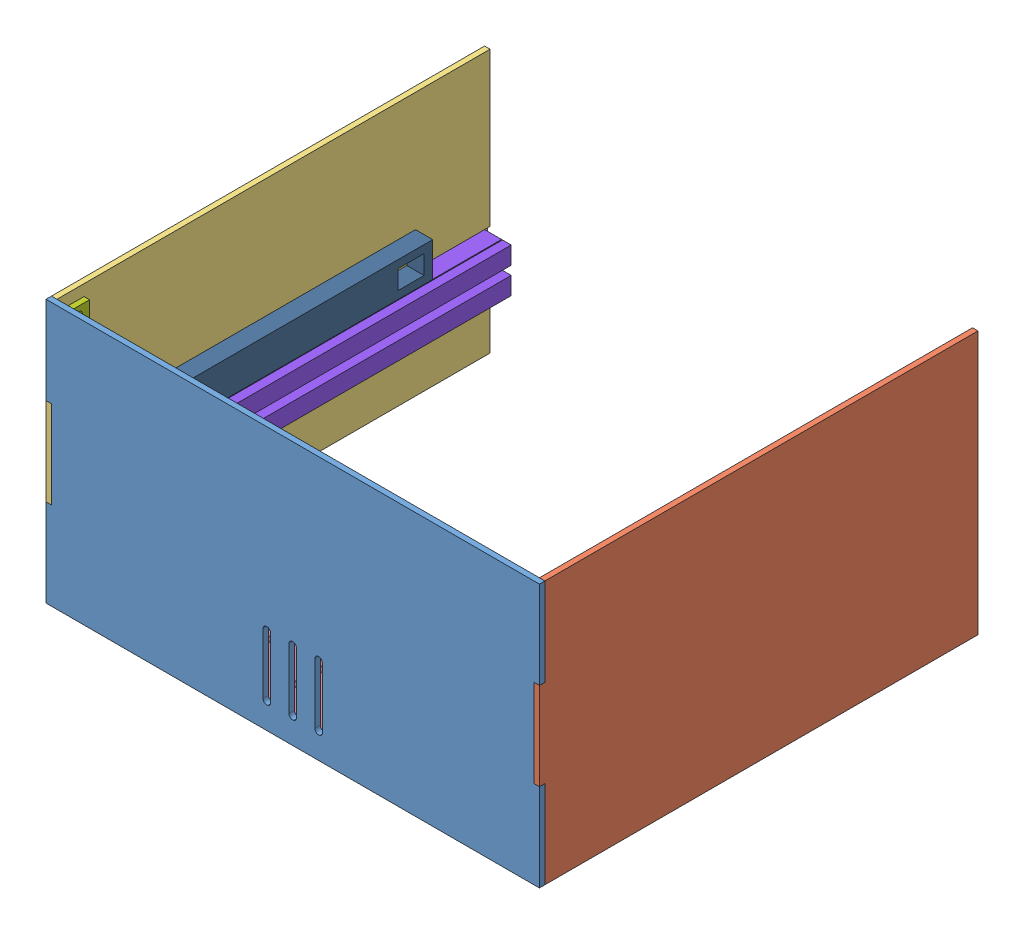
SolidWorks assembly Rear Storage Assembly.SLDASM, configuration Default (file format 15000). Lengths in mm.
Overall size (285.75 159.48 254).
27 component instances, 11 part files, 51 mates.
Components (placement in the parent):
- Back-1: Back.SLDPRT [Default] at (107.9127 113.5491 195.6866) size (285.75 152.4 3.17)
- Side L-1: Side L.SLDPRT [Default] at (249.2002 113.5491 70.2741) size (3.17 152.4 254)
- Side R-1: Side R.SLDPRT [Default] at (-33.3748 113.5491 70.2741) size (3.17 152.4 254)
- 535052 assembly.STEP-1: 535052 assembly.STEP.SLDASM [Default] at (282.3286 130.5293 143.5678) x (0.707107 0 -0.707107) z (-0.707107 0 -0.707107) size (49.1 20.57 32.16) (suppressed, hidden)
  - 535052 housing.STEP-1: 535052 housing.STEP.SLDPRT [Default] at (-60.2789 7.3005 21.3437) size (49.1 16.21 32.16)
  - 535052 ball.STEP-1: 535052 ball.STEP.SLDPRT [Default] at (-60.2789 7.3005 21.3437) size (15.88 15.88 15.88)
- Ball Transfer Bracket-1: Ball Transfer Bracket.SLDPRT [Default] at (224.6127 123.2288 171.0991) (suppressed, hidden)
- 535052 assembly.STEP-2: 535052 assembly.STEP.SLDASM [Default] at (-36.3186 130.5293 113.3832) x (-0.707107 0 -0.707107) z (-0.707107 0 0.707107) size (49.1 20.57 32.16) (suppressed, hidden)
  - 535052 housing.STEP-1: 535052 housing.STEP.SLDPRT [Default] at (-60.2789 7.3005 21.3437) size (49.1 16.21 32.16)
  - 535052 ball.STEP-1: 535052 ball.STEP.SLDPRT [Default] at (-60.2789 7.3005 21.3437) size (15.88 15.88 15.88)
- Ball Transfer Bracket-2: Ball Transfer Bracket.SLDPRT [Default] at (-8.7873 123.2288 171.0991) x (0 0 1) z (-1 0 0) (suppressed, hidden)
- 57655K62_14-1 2 Degree Pressure Angle Gear Rack-1: 57655K62_14-1 2 Degree Pressure Angle Gear Rack.SLDPRT [57655K62] at (246.819 154.0304 63.9241) x (0 0 1) z (0 -1 0) (suppressed, hidden)
- 57655K62_14-1 2 Degree Pressure Angle Gear Rack-2: 57655K62_14-1 2 Degree Pressure Angle Gear Rack.SLDPRT [57655K62] at (-30.9935 154.0304 63.9241) x (0 0 1) z (0 1 0) (suppressed, hidden)
- Ball Transfer Alt Bracket-1: Ball Transfer Alt Bracket.SLDPRT [Default] at (107.9127 127.0474 176.5991) size (50 40 35)
- 535052 assembly.STEP-3: 535052 assembly.STEP.SLDASM [Default] at (168.1916 134.3479 197.9428) x (1 0 0) z (0 0 -1) size (49.1 20.57 32.16)
  - 535052 housing.STEP-1: 535052 housing.STEP.SLDPRT [Default] at (-60.2789 7.3005 21.3437) size (49.1 16.21 32.16)
  - 535052 ball.STEP-1: 535052 ball.STEP.SLDPRT [Default] at (-60.2789 7.3005 21.3437) size (15.88 15.88 15.88)
- Corner Bracket-1: Corner Bracket.SLDPRT [Default] at (238.1827 246.9505 194.0991) x (1 0 0) z (0 1 0) size (15.68 15.68 25)
- Corner Bracket-2: Corner Bracket.SLDPRT [Default] at (247.6127 132.769 184.6691) x (0 0 1) z (0 -1 0) size (15.68 15.68 25)
- Corner Bracket-5: Corner Bracket.SLDPRT [Default] at (-31.7873 132.769 184.6691) x (0 0 1) z (0 1 0) size (15.68 15.68 25)
- Corner Bracket-6: Corner Bracket.SLDPRT [Default] at (-22.3573 246.9505 194.0991) x (-1 0 0) z (0 -1 0) size (15.68 15.68 25)
- Rack Casing-1: Rack Casing.SLDPRT [Default] at (243.4852 164.3491 187.7491) x (-1 0 0) z (0 -1 0) size (17.02 241.3 25.4)
- 57655K62_14-1 2 Degree Pressure Angle Gear Rack-3: 57655K62_14-1 2 Degree Pressure Angle Gear Rack.SLDPRT [57655K62] at (244.279 164.5079 67.0991) x (0 0 -1) z (0 1 0)
- Lock Loop-2: Lock Loop.SLDPRT [Default] at (237.6127 187.0491 -1.0186) x (0 0 1) z (0 1 0) size (177 10 20)
- Rack Casing-2: Rack Casing.SLDPRT [Default] at (-27.6598 164.3491 -53.5509) x (1 0 0) z (0 -1 0) size (17.02 241.3 25.4)
- Lock Loop-3: Lock Loop.SLDPRT [Default] at (-21.7873 187.0491 150.9814) x (0 0 -1) z (0 1 0) size (177 10 20)
- 57655K62_14-1 2 Degree Pressure Angle Gear Rack-4: 57655K62_14-1 2 Degree Pressure Angle Gear Rack.SLDPRT [57655K62] at (-28.4535 164.1904 67.0991) x (0 0 1) z (0 1 0)
Mates (geometry in assembly coordinates):
- Coincident1: coincident aligned: plane of Back-1 through (-34.9623 265.9491 197.2741) normal (0 0 1); plane of Side L-1 through (247.6127 265.9491 197.2741) normal (0 0 1)
- Coincident2: coincident anti-aligned: plane of Back-1 through (247.6127 164.3491 194.0991) normal (1 0 0); plane of Side L-1 through (247.6127 265.9491 -56.7259) normal (-1 0 0)
- Coincident3: coincident anti-aligned: plane of Back-1 through (250.7877 164.3491 194.0991) normal (0 1 0); plane of Side L-1 through (250.7877 164.3491 197.2741) normal (0 -1 0)
- Coincident4: coincident anti-aligned: plane of Back-1 through (-34.9623 215.1491 194.0991) normal (0 -1 0); plane of Side R-1 through (-31.7873 215.1491 197.2741) normal (0 1 0)
- Coincident5: coincident aligned: plane of Back-1 through (-34.9623 265.9491 197.2741) normal (0 0 1); plane of Side R-1 through (-34.9623 265.9491 197.2741) normal (0 0 1)
- Coincident6: coincident aligned: plane of Back-1 through (-34.9623 265.9491 197.2741) normal (-1 0 0); plane of Side R-1 through (-34.9623 265.9491 -56.7259) normal (-1 0 0)
- Coincident7: coincident anti-aligned: plane of Back-1 through (-34.9623 265.9491 194.0991) normal (0 0 -1); plane of Ball Transfer Bracket-1 through (204.6127 163.2288 194.0991) normal (0 0 1)
- Coincident8: coincident anti-aligned: plane of Side L-1 through (247.6127 265.9491 -56.7259) normal (-1 0 0); plane of Ball Transfer Bracket-1 through (247.6127 163.2288 191.0991) normal (1 0 0)
- Coincident9: coincident anti-aligned: plane of 535052 assembly.STEP-1/535052 housing.STEP-1 through (210.415 123.2288 185.2969) normal (0 1 0); plane of Ball Transfer Bracket-1 through (224.6127 123.2288 171.0991) normal (0 -1 0)
- Concentric1: concentric aligned: cylinder of 535052 assembly.STEP-1/535052 housing.STEP-1 through (238.8105 123.2288 156.9013) axis (0 -1 0) radius 2.1844; cylinder of Ball Transfer Bracket-1 through (238.8105 126.2288 156.9013) axis (0 -1 0) radius 2.1844
- Concentric2: concentric aligned: cylinder of 535052 assembly.STEP-1/535052 housing.STEP-1 through (210.415 123.2288 185.2969) axis (0 -1 0) radius 2.1844; cylinder of Ball Transfer Bracket-1 through (210.415 126.2288 185.2969) axis (0 -1 0) radius 2.1844
- Coincident10: coincident anti-aligned: plane of Back-1 through (-34.9623 265.9491 194.0991) normal (0 0 -1); plane of Ball Transfer Bracket-2 through (-28.7873 163.2288 194.0991) normal (0 0 1)
- Coincident11: coincident anti-aligned: plane of Side R-1 through (-31.7873 265.9491 -56.7259) normal (1 0 0); plane of Ball Transfer Bracket-2 through (-31.7873 163.2288 151.0991) normal (-1 0 0)
- Coincident12: coincident aligned: plane of Ball Transfer Bracket-1 through (224.6127 163.2288 171.0991) normal (0 1 0); plane of Ball Transfer Bracket-2 through (-8.7873 163.2288 171.0991) normal (0 1 0)
- Coincident13: coincident anti-aligned: plane of 535052 assembly.STEP-2/535052 housing.STEP-1 through (5.4105 123.2288 185.2969) normal (0 1 0); plane of Ball Transfer Bracket-2 through (-8.7873 123.2288 171.0991) normal (0 -1 0)
- Concentric3: concentric aligned: cylinder of 535052 assembly.STEP-2/535052 housing.STEP-1 through (-22.985 123.2288 156.9013) axis (0 -1 0) radius 2.1844; cylinder of Ball Transfer Bracket-2 through (-22.985 126.2288 156.9013) axis (0 -1 0) radius 2.1844
- Concentric4: concentric aligned: cylinder of 535052 assembly.STEP-2/535052 housing.STEP-1 through (5.4105 123.2288 185.2969) axis (0 -1 0) radius 2.1844; cylinder of Ball Transfer Bracket-2 through (5.4105 126.2288 185.2969) axis (0 -1 0) radius 2.1844
- Coincident14: coincident anti-aligned: plane of Side L-1 through (249.2002 113.5491 70.2741) normal (-1 0 0); plane of 57655K62_14-1 2 Degree Pressure Angle Gear Rack-1 through (249.2002 151.6491 -56.7259) normal (1 0 0)
- Parallel1: parallel anti-aligned: plane of Side L-1 through (247.6127 265.9491 -56.7259) normal (0 0 -1); plane of 57655K62_14-1 2 Degree Pressure Angle Gear Rack-1 through (249.2002 151.6491 184.5741) normal (0 0 1)
- Coincident16: coincident anti-aligned: plane of Side L-1 through (249.2002 151.6491 -56.7259) normal (0 1 0); plane of 57655K62_14-1 2 Degree Pressure Angle Gear Rack-1 through (244.4377 151.6491 184.5741) normal (0 -1 0)
- Coincident17: coincident anti-aligned: plane of Side R-1 through (-33.3748 113.5491 70.2741) normal (1 0 0); plane of 57655K62_14-1 2 Degree Pressure Angle Gear Rack-2 through (-33.3748 156.4116 -56.7259) normal (-1 0 0)
- Coincident19: coincident anti-aligned: plane of Side R-1 through (-33.3748 151.6491 -56.7259) normal (0 1 0); plane of 57655K62_14-1 2 Degree Pressure Angle Gear Rack-2 through (-28.6123 151.6491 184.5741) normal (0 -1 0)
- Coincident20: coincident aligned: plane of Side R-1 through (-34.9623 265.9491 -56.7259) normal (0 0 -1); plane of 57655K62_14-1 2 Degree Pressure Angle Gear Rack-2 through (-33.3748 156.4116 -56.7259) normal (0 0 -1)
- Coincident21: coincident aligned: plane of Side L-1 through (247.6127 265.9491 -56.7259) normal (0 0 -1); plane of 57655K62_14-1 2 Degree Pressure Angle Gear Rack-1 through (249.2002 151.6491 -56.7259) normal (0 0 -1)
- Tangent1: tangent anti-aligned: plane of Back-1 through (125.0971 113.5491 194.0991) normal (-1 0 0); cylinder of Ball Transfer Alt Bracket-1 through (122.9127 157.0474 194.0991) axis (0 0 -1) radius 2.1844
- Tangent2: tangent anti-aligned: plane of Back-1 through (110.0971 113.5491 194.0991) normal (-1 0 0); cylinder of Ball Transfer Alt Bracket-1 through (107.9127 142.0474 194.0991) axis (0 0 -1) radius 2.1844
- Coincident22: coincident anti-aligned: plane of Back-1 through (-34.9623 265.9491 194.0991) normal (0 0 -1); plane of Ball Transfer Alt Bracket-1 through (82.9127 130.0474 194.0991) normal (0 0 1)
- Concentric5: concentric aligned: cylinder of Ball Transfer Alt Bracket-1 through (87.834 130.0474 176.5991) axis (0 -1 0) radius 2.1844; cylinder of 535052 assembly.STEP-3/535052 housing.STEP-1 through (87.834 127.0474 176.5991) axis (0 -1 0) radius 2.1844
- Concentric6: concentric aligned: cylinder of Ball Transfer Alt Bracket-1 through (127.9914 130.0474 176.5991) axis (0 -1 0) radius 2.1844; cylinder of 535052 assembly.STEP-3/535052 housing.STEP-1 through (127.9914 127.0474 176.5991) axis (0 -1 0) radius 2.1844
- Coincident23: coincident anti-aligned: plane of Ball Transfer Alt Bracket-1 through (107.9127 127.0474 176.5991) normal (0 -1 0); plane of 535052 assembly.STEP-3/535052 housing.STEP-1 through (87.834 127.0474 176.5991) normal (0 1 0)
- Coincident24: coincident anti-aligned: plane of Side L-1 through (247.6127 265.9491 -56.7259) normal (-1 0 0); plane of Corner Bracket-1 through (247.6127 259.4505 178.4241) normal (1 0 0)
- Coincident25: coincident anti-aligned: plane of Back-1 through (-34.9623 265.9491 194.0991) normal (0 0 -1); plane of Corner Bracket-1 through (238.1827 246.9505 194.0991) normal (0 0 1)
- Coincident26: coincident anti-aligned: plane of Side L-1 through (247.6127 265.9491 -56.7259) normal (-1 0 0); plane of Corner Bracket-2 through (247.6127 132.769 184.6691) normal (1 0 0)
- Coincident27: coincident anti-aligned: plane of Back-1 through (-34.9623 265.9491 194.0991) normal (0 0 -1); plane of Corner Bracket-2 through (231.9377 120.269 194.0991) normal (0 0 1)
- Coincident28: coincident anti-aligned: plane of Side L-1 through (249.2002 113.5491 70.2741) normal (-1 0 0); plane of Rack Casing-1 through (249.2002 177.0491 -53.5509) normal (1 0 0)
- Coincident29: coincident anti-aligned: plane of Side L-1 through (249.2002 177.0491 -56.7259) normal (0 -1 0); plane of Rack Casing-1 through (249.2002 177.0491 -53.5509) normal (0 1 0)
- Coincident30: coincident anti-aligned: plane of Side L-1 through (249.2002 177.0491 187.7491) normal (0 0 -1); plane of Rack Casing-1 through (243.4852 164.3491 187.7491) normal (0 0 1)
- Coincident31: coincident aligned: plane of Rack Casing-1 through (243.4852 164.3491 187.7491) normal (0 0 1); plane of 57655K62_14-1 2 Degree Pressure Angle Gear Rack-3 through (246.6602 166.8891 187.7491) normal (0 0 1)
- Coincident32: coincident anti-aligned: plane of Rack Casing-1 through (246.6602 166.8891 -53.5509) normal (-1 0 0); plane of 57655K62_14-1 2 Degree Pressure Angle Gear Rack-3 through (246.6602 166.8891 187.7491) normal (1 0 0)
- Coincident33: coincident anti-aligned: plane of Rack Casing-1 through (246.6602 166.8891 -53.5509) normal (0 -1 0); plane of 57655K62_14-1 2 Degree Pressure Angle Gear Rack-3 through (241.8977 166.8891 -53.5509) normal (0 1 0)
- Coincident36: coincident anti-aligned: plane of Rack Casing-1 through (249.2002 177.0491 -53.5509) normal (0 1 0); plane of Lock Loop-2 through (247.6127 177.0491 -1.0186) normal (0 -1 0)
- Coincident37: coincident anti-aligned: plane of Side L-1 through (247.6127 265.9491 -56.7259) normal (-1 0 0); plane of Lock Loop-2 through (247.6127 187.0491 -1.0186) normal (1 0 0)
- Coincident38: coincident anti-aligned: plane of Side R-1 through (-33.3748 113.5491 70.2741) normal (1 0 0); plane of Rack Casing-2 through (-33.3748 177.0491 187.7491) normal (-1 0 0)
- Coincident39: coincident anti-aligned: plane of Side R-1 through (-33.3748 177.0491 187.7491) normal (0 0 -1); plane of Rack Casing-2 through (-27.6598 164.3491 187.7491) normal (0 0 1)
- Coincident40: coincident anti-aligned: plane of Side R-1 through (-33.3748 177.0491 -56.7259) normal (0 -1 0); plane of Rack Casing-2 through (-33.3748 177.0491 187.7491) normal (0 1 0)
- Coincident41: coincident anti-aligned: plane of Rack Casing-2 through (-30.8348 166.8891 187.7491) normal (1 0 0); plane of 57655K62_14-1 2 Degree Pressure Angle Gear Rack-4 through (-30.8348 166.5716 -53.5509) normal (-1 0 0)
- Coincident42: coincident anti-aligned: plane of Rack Casing-2 through (-30.8348 161.8091 187.7491) normal (0 1 0); plane of 57655K62_14-1 2 Degree Pressure Angle Gear Rack-4 through (-26.0723 161.8091 187.7491) normal (0 -1 0)
- Coincident43: coincident aligned: plane of Rack Casing-2 through (-27.6598 164.3491 -53.5509) normal (0 0 -1); plane of 57655K62_14-1 2 Degree Pressure Angle Gear Rack-4 through (-30.8348 166.5716 -53.5509) normal (0 0 -1)
- Coincident44: coincident anti-aligned: plane of Rack Casing-2 through (-33.3748 177.0491 187.7491) normal (0 1 0); plane of Lock Loop-3 through (-31.7873 177.0491 150.9814) normal (0 -1 0)
- Coincident45: coincident anti-aligned: plane of Side R-1 through (-31.7873 265.9491 -56.7259) normal (1 0 0); plane of Lock Loop-3 through (-31.7873 187.0491 150.9814) normal (-1 0 0)
- Coincident46: coincident aligned: plane of Lock Loop-2 through (247.6127 187.0491 -13.5186) normal (0 0 -1); plane of Lock Loop-3 through (-31.7873 187.0491 -13.5186) normal (0 0 -1)
